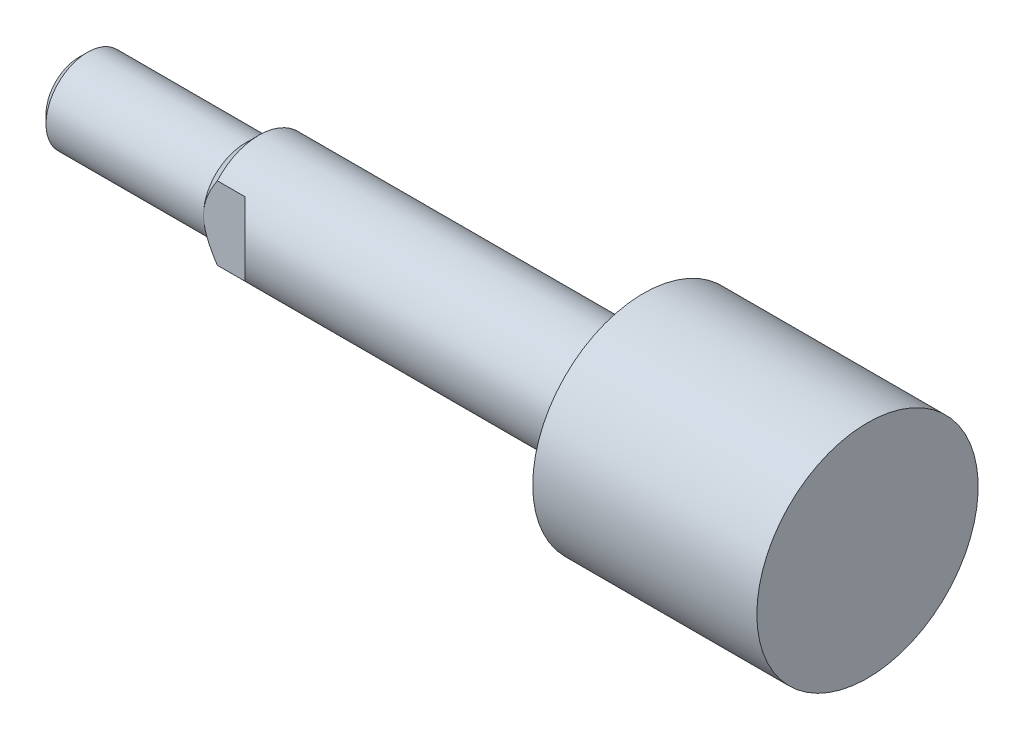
ISO-10303-21;
HEADER;
FILE_DESCRIPTION(('STEP AP214'),'2;1');
FILE_NAME('part.step','',(''),(''),'','','');
FILE_SCHEMA(('AUTOMOTIVE_DESIGN { 1 0 10303 214 1 1 1 1 }'));
ENDSEC;
DATA;
#1=APPLICATION_CONTEXT('core data for automotive mechanical design processes');
#2=APPLICATION_PROTOCOL_DEFINITION('international standard','automotive_design',2000,#1);
#3=PRODUCT_CONTEXT('',#1,'mechanical');
#4=PRODUCT('Part','Part','',(#3));
#5=PRODUCT_RELATED_PRODUCT_CATEGORY('part','',(#4));
#6=PRODUCT_DEFINITION_FORMATION('','',#4);
#7=PRODUCT_DEFINITION_CONTEXT('part definition',#1,'design');
#8=PRODUCT_DEFINITION('design','',#6,#7);
#9=PRODUCT_DEFINITION_SHAPE('','',#8);
#10=(LENGTH_UNIT() NAMED_UNIT(*) SI_UNIT(.MILLI.,.METRE.));
#11=(NAMED_UNIT(*) PLANE_ANGLE_UNIT() SI_UNIT($,.RADIAN.));
#12=(NAMED_UNIT(*) SI_UNIT($,.STERADIAN.) SOLID_ANGLE_UNIT());
#13=UNCERTAINTY_MEASURE_WITH_UNIT(LENGTH_MEASURE(1.E-05),#10,'distance_accuracy_value','');
#14=(GEOMETRIC_REPRESENTATION_CONTEXT(3) GLOBAL_UNCERTAINTY_ASSIGNED_CONTEXT((#13)) GLOBAL_UNIT_ASSIGNED_CONTEXT((#10,
#11,#12)) REPRESENTATION_CONTEXT('',''));
#15=CARTESIAN_POINT('',(0.,0.,0.));
#16=DIRECTION('',(0.,0.,1.));
#17=DIRECTION('',(1.,0.,0.));
#18=AXIS2_PLACEMENT_3D('',#15,#16,#17);
#19=CARTESIAN_POINT('',(-2.5,0.,0.));
#20=DIRECTION('',(1.,0.,0.));
#21=DIRECTION('',(0.,0.,-1.));
#22=AXIS2_PLACEMENT_3D('',#19,#20,#21);
#23=CONICAL_SURFACE('',#22,4.,0.785398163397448);
#24=CARTESIAN_POINT('',(-2.5,0.,0.));
#25=DIRECTION('',(-1.,0.,0.));
#26=DIRECTION('',(0.,0.,1.));
#27=AXIS2_PLACEMENT_3D('',#24,#25,#26);
#28=CIRCLE('',#27,4.);
#29=CARTESIAN_POINT('',(-2.5,2.64575131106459,3.));
#30=VERTEX_POINT('',#29);
#31=CARTESIAN_POINT('',(-2.5,2.64575131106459,-3.));
#32=VERTEX_POINT('',#31);
#33=EDGE_CURVE('E86',#30,#32,#28,.T.);
#34=ORIENTED_EDGE('',*,*,#33,.T.);
#35=CARTESIAN_POINT('',(0.0545194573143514,-5.82766894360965,-3.));
#36=CARTESIAN_POINT('',(-0.0655117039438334,-5.69264565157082,-3.));
#37=CARTESIAN_POINT('',(-0.185077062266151,-5.55720424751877,-3.));
#38=CARTESIAN_POINT('',(-0.423026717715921,-5.28526281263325,-3.));
#39=CARTESIAN_POINT('',(-0.541410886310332,-5.14876266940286,-3.));
#40=CARTESIAN_POINT('',(-0.777239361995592,-4.87390823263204,-3.));
#41=CARTESIAN_POINT('',(-0.894677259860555,-4.73554842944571,-3.));
#42=CARTESIAN_POINT('',(-1.12769999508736,-4.45728579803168,-3.));
#43=CARTESIAN_POINT('',(-1.24328492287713,-4.31738304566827,-3.));
#44=CARTESIAN_POINT('',(-1.478812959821,-4.0273935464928,-3.));
#45=CARTESIAN_POINT('',(-1.59861383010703,-3.87719092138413,-3.));
#46=CARTESIAN_POINT('',(-1.83471594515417,-3.57406261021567,-3.));
#47=CARTESIAN_POINT('',(-1.95101741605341,-3.42113710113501,-3.));
#48=CARTESIAN_POINT('',(-2.17867048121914,-3.11204258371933,-3.));
#49=CARTESIAN_POINT('',(-2.29003042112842,-2.9558797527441,-3.));
#50=CARTESIAN_POINT('',(-2.50611292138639,-2.63905224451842,-3.));
#51=CARTESIAN_POINT('',(-2.61083789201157,-2.47838923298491,-3.));
#52=CARTESIAN_POINT('',(-2.78024812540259,-2.20105121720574,-3.));
#53=CARTESIAN_POINT('',(-2.84740797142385,-2.08589532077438,-3.));
#54=CARTESIAN_POINT('',(-2.97566018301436,-1.85216902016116,-3.));
#55=CARTESIAN_POINT('',(-3.03675066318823,-1.73359756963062,-3.));
#56=CARTESIAN_POINT('',(-3.15040846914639,-1.49359958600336,-3.));
#57=CARTESIAN_POINT('',(-3.20304246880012,-1.37220500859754,-3.));
#58=CARTESIAN_POINT('',(-3.29788029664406,-1.12539482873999,-3.));
#59=CARTESIAN_POINT('',(-3.34009071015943,-0.999981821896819,-3.));
#60=CARTESIAN_POINT('',(-3.40000142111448,-0.785495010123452,-3.));
#61=CARTESIAN_POINT('',(-3.42123449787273,-0.697409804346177,-3.));
#62=CARTESIAN_POINT('',(-3.45654228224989,-0.519807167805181,-3.));
#63=CARTESIAN_POINT('',(-3.47061822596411,-0.430289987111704,-3.));
#64=CARTESIAN_POINT('',(-3.49087054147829,-0.250605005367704,-3.));
#65=CARTESIAN_POINT('',(-3.49706868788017,-0.160439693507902,-3.));
#66=CARTESIAN_POINT('',(-3.50128995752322,0.0200867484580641,-3.));
#67=CARTESIAN_POINT('',(-3.49931298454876,0.110447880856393,-3.));
#68=CARTESIAN_POINT('',(-3.48730850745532,0.290452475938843,-3.));
#69=CARTESIAN_POINT('',(-3.47729628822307,0.38009697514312,-3.));
#70=CARTESIAN_POINT('',(-3.44977513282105,0.558232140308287,-3.));
#71=CARTESIAN_POINT('',(-3.43226439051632,0.646722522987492,-3.));
#72=CARTESIAN_POINT('',(-3.39048841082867,0.822421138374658,-3.));
#73=CARTESIAN_POINT('',(-3.36619833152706,0.909623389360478,-3.));
#74=CARTESIAN_POINT('',(-3.31183291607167,1.0821820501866,-3.));
#75=CARTESIAN_POINT('',(-3.28175761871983,1.16753847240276,-3.));
#76=CARTESIAN_POINT('',(-3.20665207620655,1.36255972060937,-3.));
#77=CARTESIAN_POINT('',(-3.15987705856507,1.47154946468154,-3.));
#78=CARTESIAN_POINT('',(-3.05976597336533,1.68649433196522,-3.));
#79=CARTESIAN_POINT('',(-3.00642658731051,1.79244788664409,-3.));
#80=CARTESIAN_POINT('',(-2.8945308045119,2.00181172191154,-3.));
#81=CARTESIAN_POINT('',(-2.83596429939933,2.10521655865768,-3.));
#82=CARTESIAN_POINT('',(-2.71482595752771,2.30961365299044,-3.));
#83=CARTESIAN_POINT('',(-2.65225477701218,2.41060630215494,-3.));
#84=CARTESIAN_POINT('',(-2.52301843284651,2.61197774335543,-3.));
#85=CARTESIAN_POINT('',(-2.45630744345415,2.71232698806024,-3.));
#86=CARTESIAN_POINT('',(-2.32027971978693,2.91124115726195,-3.));
#87=CARTESIAN_POINT('',(-2.25096290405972,3.00980602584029,-3.));
#88=CARTESIAN_POINT('',(-2.11031358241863,3.20530008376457,-3.));
#89=CARTESIAN_POINT('',(-2.03898364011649,3.30223112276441,-3.));
#90=CARTESIAN_POINT('',(-1.89461337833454,3.49480227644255,-3.));
#91=CARTESIAN_POINT('',(-1.82157312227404,3.59044243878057,-3.));
#92=CARTESIAN_POINT('',(-1.6598676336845,3.79894899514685,-3.));
#93=CARTESIAN_POINT('',(-1.57090369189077,3.91158345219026,-3.));
#94=CARTESIAN_POINT('',(-1.39134957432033,4.1355501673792,-3.));
#95=CARTESIAN_POINT('',(-1.30075935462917,4.24688239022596,-3.));
#96=CARTESIAN_POINT('',(-1.02698944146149,4.57927058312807,-3.));
#97=CARTESIAN_POINT('',(-0.841828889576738,4.79869462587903,-3.));
#98=CARTESIAN_POINT('',(-0.467797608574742,5.23449193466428,-3.));
#99=CARTESIAN_POINT('',(-0.278925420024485,5.45086394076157,-3.));
#100=CARTESIAN_POINT('',(0.10146128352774,5.88127733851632,-3.));
#101=CARTESIAN_POINT('',(0.292975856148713,6.09531867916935,-3.));
#102=CARTESIAN_POINT('',(0.678347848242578,6.52204578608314,-3.));
#103=CARTESIAN_POINT('',(0.872209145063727,6.73472804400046,-3.));
#104=CARTESIAN_POINT('',(1.2614457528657,7.15870603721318,-3.));
#105=CARTESIAN_POINT('',(1.45682108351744,7.370001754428,-3.));
#106=CARTESIAN_POINT('',(2.04459894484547,8.00215026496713,-3.));
#107=CARTESIAN_POINT('',(2.43875284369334,8.42137383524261,-3.));
#108=CARTESIAN_POINT('',(3.18336011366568,9.20767583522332,-3.));
#109=CARTESIAN_POINT('',(3.53348148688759,9.5750696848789,-3.));
#110=CARTESIAN_POINT('',(4.23542736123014,10.3082794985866,-3.));
#111=CARTESIAN_POINT('',(4.58725198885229,10.6740953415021,-3.));
#112=CARTESIAN_POINT('',(5.29094267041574,11.4033091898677,-3.));
#113=CARTESIAN_POINT('',(5.64280459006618,11.7667111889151,-3.));
#114=CARTESIAN_POINT('',(6.34744425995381,12.4925661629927,-3.));
#115=CARTESIAN_POINT('',(6.700221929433,12.8550192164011,-3.));
#116=CARTESIAN_POINT('',(7.05333509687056,13.2171438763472,-3.));
#117=B_SPLINE_CURVE_WITH_KNOTS('',3,(#35,#36,#37,#38,#39,#40,#41,#42,#43,#44,#45,#46,#47,#48,
#49,#50,#51,#52,#53,#54,#55,#56,#57,#58,#59,#60,#61,#62,#63,#64,#65,#66,#67,#68,#69,#70,#71,#72,
#73,#74,#75,#76,#77,#78,#79,#80,#81,#82,#83,#84,#85,#86,#87,#88,#89,#90,#91,#92,#93,#94,#95,#96,
#97,#98,#99,#100,#101,#102,#103,#104,#105,#106,#107,#108,#109,#110,#111,#112,#113,#114,#115,
#116),.UNSPECIFIED.,.F.,.F.,(4,2,2,2,2,2,2,2,2,2,2,2,2,2,2,2,2,2,2,2,2,2,2,2,2,2,2,2,2,2,2,2,2,
2,2,2,2,2,2,2,4),(0.,0.541989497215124,1.084037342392,1.62846524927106,2.17286650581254,
2.74921195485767,3.32552007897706,3.90081464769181,4.47589901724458,4.87569159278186,
5.27560797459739,5.67219758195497,6.06853599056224,6.34010826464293,6.6116336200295,
6.88240682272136,7.15318321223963,7.42344574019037,7.69377340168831,7.96510494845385,
8.23643467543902,8.5919518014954,8.9476493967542,9.30405040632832,9.66039316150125,
10.0218435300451,10.383305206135,10.7443256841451,11.1053327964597,11.5359059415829,
11.966490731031,12.8277497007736,13.6893543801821,14.5509778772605,15.4143015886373,
16.2776365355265,18.0038627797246,19.5263781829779,21.0490084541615,22.566508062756,
24.083878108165),.UNSPECIFIED.);
#118=CARTESIAN_POINT('',(-3.5,0.,-3.));
#119=VERTEX_POINT('',#118);
#120=EDGE_CURVE('E89',#32,#119,#117,.F.);
#121=ORIENTED_EDGE('',*,*,#120,.T.);
#122=CARTESIAN_POINT('',(-3.5,0.,0.));
#123=DIRECTION('',(-1.,0.,0.));
#124=DIRECTION('',(0.,0.,1.));
#125=AXIS2_PLACEMENT_3D('',#122,#123,#124);
#126=CIRCLE('',#125,3.);
#127=CARTESIAN_POINT('',(-3.5,0.,3.));
#128=VERTEX_POINT('',#127);
#129=EDGE_CURVE('E85',#128,#119,#126,.T.);
#130=ORIENTED_EDGE('',*,*,#129,.F.);
#131=CARTESIAN_POINT('',(0.0545194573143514,-5.82766894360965,3.));
#132=CARTESIAN_POINT('',(-0.0655117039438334,-5.69264565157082,3.));
#133=CARTESIAN_POINT('',(-0.185077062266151,-5.55720424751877,3.));
#134=CARTESIAN_POINT('',(-0.423026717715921,-5.28526281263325,3.));
#135=CARTESIAN_POINT('',(-0.541410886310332,-5.14876266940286,3.));
#136=CARTESIAN_POINT('',(-0.777239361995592,-4.87390823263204,3.));
#137=CARTESIAN_POINT('',(-0.894677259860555,-4.73554842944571,3.));
#138=CARTESIAN_POINT('',(-1.12769999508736,-4.45728579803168,3.));
#139=CARTESIAN_POINT('',(-1.24328492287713,-4.31738304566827,3.));
#140=CARTESIAN_POINT('',(-1.478812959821,-4.0273935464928,3.));
#141=CARTESIAN_POINT('',(-1.59861383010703,-3.87719092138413,3.));
#142=CARTESIAN_POINT('',(-1.83471594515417,-3.57406261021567,3.));
#143=CARTESIAN_POINT('',(-1.95101741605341,-3.42113710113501,3.));
#144=CARTESIAN_POINT('',(-2.17867048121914,-3.11204258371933,3.));
#145=CARTESIAN_POINT('',(-2.29003042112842,-2.9558797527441,3.));
#146=CARTESIAN_POINT('',(-2.50611292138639,-2.63905224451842,3.));
#147=CARTESIAN_POINT('',(-2.61083789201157,-2.47838923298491,3.));
#148=CARTESIAN_POINT('',(-2.78024812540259,-2.20105121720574,3.));
#149=CARTESIAN_POINT('',(-2.84740797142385,-2.08589532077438,3.));
#150=CARTESIAN_POINT('',(-2.97566018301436,-1.85216902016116,3.));
#151=CARTESIAN_POINT('',(-3.03675066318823,-1.73359756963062,3.));
#152=CARTESIAN_POINT('',(-3.15040846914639,-1.49359958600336,3.));
#153=CARTESIAN_POINT('',(-3.20304246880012,-1.37220500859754,3.));
#154=CARTESIAN_POINT('',(-3.29788029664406,-1.12539482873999,3.));
#155=CARTESIAN_POINT('',(-3.34009071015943,-0.999981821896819,3.));
#156=CARTESIAN_POINT('',(-3.40000142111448,-0.785495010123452,3.));
#157=CARTESIAN_POINT('',(-3.42123449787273,-0.697409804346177,3.));
#158=CARTESIAN_POINT('',(-3.45654228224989,-0.519807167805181,3.));
#159=CARTESIAN_POINT('',(-3.47061822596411,-0.430289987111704,3.));
#160=CARTESIAN_POINT('',(-3.49087054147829,-0.250605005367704,3.));
#161=CARTESIAN_POINT('',(-3.49706868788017,-0.160439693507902,3.));
#162=CARTESIAN_POINT('',(-3.50128995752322,0.0200867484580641,3.));
#163=CARTESIAN_POINT('',(-3.49931298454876,0.110447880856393,3.));
#164=CARTESIAN_POINT('',(-3.48730850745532,0.290452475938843,3.));
#165=CARTESIAN_POINT('',(-3.47729628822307,0.38009697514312,3.));
#166=CARTESIAN_POINT('',(-3.44977513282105,0.558232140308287,3.));
#167=CARTESIAN_POINT('',(-3.43226439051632,0.646722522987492,3.));
#168=CARTESIAN_POINT('',(-3.39048841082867,0.822421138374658,3.));
#169=CARTESIAN_POINT('',(-3.36619833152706,0.909623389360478,3.));
#170=CARTESIAN_POINT('',(-3.31183291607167,1.0821820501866,3.));
#171=CARTESIAN_POINT('',(-3.28175761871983,1.16753847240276,3.));
#172=CARTESIAN_POINT('',(-3.20665207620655,1.36255972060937,3.));
#173=CARTESIAN_POINT('',(-3.15987705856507,1.47154946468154,3.));
#174=CARTESIAN_POINT('',(-3.05976597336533,1.68649433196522,3.));
#175=CARTESIAN_POINT('',(-3.00642658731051,1.79244788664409,3.));
#176=CARTESIAN_POINT('',(-2.8945308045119,2.00181172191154,3.));
#177=CARTESIAN_POINT('',(-2.83596429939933,2.10521655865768,3.));
#178=CARTESIAN_POINT('',(-2.71482595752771,2.30961365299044,3.));
#179=CARTESIAN_POINT('',(-2.65225477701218,2.41060630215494,3.));
#180=CARTESIAN_POINT('',(-2.52301843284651,2.61197774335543,3.));
#181=CARTESIAN_POINT('',(-2.45630744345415,2.71232698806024,3.));
#182=CARTESIAN_POINT('',(-2.32027971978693,2.91124115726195,3.));
#183=CARTESIAN_POINT('',(-2.25096290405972,3.00980602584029,3.));
#184=CARTESIAN_POINT('',(-2.11031358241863,3.20530008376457,3.));
#185=CARTESIAN_POINT('',(-2.03898364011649,3.30223112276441,3.));
#186=CARTESIAN_POINT('',(-1.89461337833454,3.49480227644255,3.));
#187=CARTESIAN_POINT('',(-1.82157312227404,3.59044243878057,3.));
#188=CARTESIAN_POINT('',(-1.6598676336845,3.79894899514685,3.));
#189=CARTESIAN_POINT('',(-1.57090369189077,3.91158345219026,3.));
#190=CARTESIAN_POINT('',(-1.39134957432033,4.1355501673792,3.));
#191=CARTESIAN_POINT('',(-1.30075935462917,4.24688239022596,3.));
#192=CARTESIAN_POINT('',(-1.02698944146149,4.57927058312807,3.));
#193=CARTESIAN_POINT('',(-0.841828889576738,4.79869462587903,3.));
#194=CARTESIAN_POINT('',(-0.467797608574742,5.23449193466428,3.));
#195=CARTESIAN_POINT('',(-0.278925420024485,5.45086394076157,3.));
#196=CARTESIAN_POINT('',(0.10146128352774,5.88127733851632,3.));
#197=CARTESIAN_POINT('',(0.292975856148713,6.09531867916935,3.));
#198=CARTESIAN_POINT('',(0.678347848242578,6.52204578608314,3.));
#199=CARTESIAN_POINT('',(0.872209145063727,6.73472804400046,3.));
#200=CARTESIAN_POINT('',(1.2614457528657,7.15870603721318,3.));
#201=CARTESIAN_POINT('',(1.45682108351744,7.370001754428,3.));
#202=CARTESIAN_POINT('',(2.04459894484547,8.00215026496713,3.));
#203=CARTESIAN_POINT('',(2.43875284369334,8.42137383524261,3.));
#204=CARTESIAN_POINT('',(3.18336011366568,9.20767583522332,3.));
#205=CARTESIAN_POINT('',(3.53348148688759,9.5750696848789,3.));
#206=CARTESIAN_POINT('',(4.23542736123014,10.3082794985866,3.));
#207=CARTESIAN_POINT('',(4.58725198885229,10.6740953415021,3.));
#208=CARTESIAN_POINT('',(5.29094267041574,11.4033091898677,3.));
#209=CARTESIAN_POINT('',(5.64280459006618,11.7667111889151,3.));
#210=CARTESIAN_POINT('',(6.34744425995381,12.4925661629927,3.));
#211=CARTESIAN_POINT('',(6.700221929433,12.8550192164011,3.));
#212=CARTESIAN_POINT('',(7.05333509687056,13.2171438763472,3.));
#213=B_SPLINE_CURVE_WITH_KNOTS('',3,(#131,#132,#133,#134,#135,#136,#137,#138,#139,#140,#141,
#142,#143,#144,#145,#146,#147,#148,#149,#150,#151,#152,#153,#154,#155,#156,#157,#158,#159,#160,
#161,#162,#163,#164,#165,#166,#167,#168,#169,#170,#171,#172,#173,#174,#175,#176,#177,#178,#179,
#180,#181,#182,#183,#184,#185,#186,#187,#188,#189,#190,#191,#192,#193,#194,#195,#196,#197,#198,
#199,#200,#201,#202,#203,#204,#205,#206,#207,#208,#209,#210,#211,#212),.UNSPECIFIED.,.F.,.F.,(4,
2,2,2,2,2,2,2,2,2,2,2,2,2,2,2,2,2,2,2,2,2,2,2,2,2,2,2,2,2,2,2,2,2,2,2,2,2,2,2,4),(0.,
0.541989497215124,1.084037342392,1.62846524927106,2.17286650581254,2.74921195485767,
3.32552007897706,3.90081464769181,4.47589901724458,4.87569159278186,5.27560797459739,
5.67219758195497,6.06853599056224,6.34010826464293,6.6116336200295,6.88240682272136,
7.15318321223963,7.42344574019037,7.69377340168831,7.96510494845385,8.23643467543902,
8.5919518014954,8.9476493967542,9.30405040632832,9.66039316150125,10.0218435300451,
10.383305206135,10.7443256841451,11.1053327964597,11.5359059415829,11.966490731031,
12.8277497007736,13.6893543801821,14.5509778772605,15.4143015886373,16.2776365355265,
18.0038627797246,19.5263781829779,21.0490084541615,22.566508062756,24.083878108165),.UNSPECIFIED.);
#214=EDGE_CURVE('E62',#128,#30,#213,.T.);
#215=ORIENTED_EDGE('',*,*,#214,.T.);
#216=EDGE_LOOP('',(#34,#121,#130,#215));
#217=FACE_BOUND('',#216,.T.);
#218=ADVANCED_FACE('F16',(#217),#23,.T.);
#219=CARTESIAN_POINT('',(41.5,0.,0.));
#220=DIRECTION('',(-1.,0.,0.));
#221=DIRECTION('',(0.,0.,1.));
#222=AXIS2_PLACEMENT_3D('',#219,#220,#221);
#223=CYLINDRICAL_SURFACE('',#222,4.);
#224=CARTESIAN_POINT('',(25.3,0.,0.));
#225=DIRECTION('',(-1.,0.,0.));
#226=DIRECTION('',(0.,0.,1.));
#227=AXIS2_PLACEMENT_3D('',#224,#225,#226);
#228=CIRCLE('',#227,4.);
#229=CARTESIAN_POINT('',(25.3,0.,4.));
#230=VERTEX_POINT('',#229);
#231=EDGE_CURVE('E71',#230,#230,#228,.T.);
#232=ORIENTED_EDGE('',*,*,#231,.T.);
#233=EDGE_LOOP('',(#232));
#234=FACE_BOUND('',#233,.T.);
#235=CARTESIAN_POINT('',(-3.5,0.,0.));
#236=DIRECTION('',(0.707106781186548,0.,0.707106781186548));
#237=DIRECTION('',(-0.707106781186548,0.,0.707106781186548));
#238=AXIS2_PLACEMENT_3D('',#235,#236,#237);
#239=ELLIPSE('',#238,5.65685424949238,4.);
#240=CARTESIAN_POINT('',(-0.5,-2.64575131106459,-3.));
#241=VERTEX_POINT('',#240);
#242=CARTESIAN_POINT('',(-0.5,2.64575131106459,-3.));
#243=VERTEX_POINT('',#242);
#244=EDGE_CURVE('E11',#241,#243,#239,.T.);
#245=ORIENTED_EDGE('',*,*,#244,.T.);
#246=DIRECTION('',(-1.,0.,0.));
#247=VECTOR('',#246,1.);
#248=CARTESIAN_POINT('',(41.5,2.64575131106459,-3.));
#249=LINE('',#248,#247);
#250=EDGE_CURVE('E183',#243,#32,#249,.T.);
#251=ORIENTED_EDGE('',*,*,#250,.T.);
#252=ORIENTED_EDGE('',*,*,#33,.F.);
#253=DIRECTION('',(-1.,0.,0.));
#254=VECTOR('',#253,1.);
#255=CARTESIAN_POINT('',(41.5,2.64575131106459,3.));
#256=LINE('',#255,#254);
#257=CARTESIAN_POINT('',(-0.5,2.64575131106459,3.));
#258=VERTEX_POINT('',#257);
#259=EDGE_CURVE('E39',#30,#258,#256,.F.);
#260=ORIENTED_EDGE('',*,*,#259,.T.);
#261=CARTESIAN_POINT('',(-3.5,0.,0.));
#262=DIRECTION('',(0.707106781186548,0.,-0.707106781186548));
#263=DIRECTION('',(-0.707106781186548,0.,-0.707106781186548));
#264=AXIS2_PLACEMENT_3D('',#261,#262,#263);
#265=ELLIPSE('',#264,5.65685424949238,4.);
#266=CARTESIAN_POINT('',(-0.5,-2.6457513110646,3.));
#267=VERTEX_POINT('',#266);
#268=EDGE_CURVE('E24',#258,#267,#265,.T.);
#269=ORIENTED_EDGE('',*,*,#268,.T.);
#270=DIRECTION('',(-1.,0.,0.));
#271=VECTOR('',#270,1.);
#272=CARTESIAN_POINT('',(41.5,-2.64575131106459,3.));
#273=LINE('',#272,#271);
#274=CARTESIAN_POINT('',(-2.4999999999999,-2.64575131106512,3.));
#275=VERTEX_POINT('',#274);
#276=EDGE_CURVE('E188',#267,#275,#273,.T.);
#277=ORIENTED_EDGE('',*,*,#276,.T.);
#278=CARTESIAN_POINT('',(-2.5,-2.64575131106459,-3.));
#279=VERTEX_POINT('',#278);
#280=EDGE_CURVE('E81',#279,#275,#28,.T.);
#281=ORIENTED_EDGE('',*,*,#280,.F.);
#282=DIRECTION('',(-1.,0.,0.));
#283=VECTOR('',#282,1.);
#284=CARTESIAN_POINT('',(41.5,-2.64575131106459,-3.));
#285=LINE('',#284,#283);
#286=EDGE_CURVE('E31',#279,#241,#285,.F.);
#287=ORIENTED_EDGE('',*,*,#286,.T.);
#288=EDGE_LOOP('',(#245,#251,#252,#260,#269,#277,#281,#287));
#289=FACE_BOUND('',#288,.T.);
#290=ADVANCED_FACE('F18',(#234,#289),#223,.T.);
#291=CARTESIAN_POINT('',(25.3,4.,0.));
#292=DIRECTION('',(1.,0.,0.));
#293=DIRECTION('',(0.,0.,-1.));
#294=AXIS2_PLACEMENT_3D('',#291,#292,#293);
#295=PLANE('',#294);
#296=ORIENTED_EDGE('',*,*,#231,.F.);
#297=EDGE_LOOP('',(#296));
#298=FACE_BOUND('',#297,.T.);
#299=CARTESIAN_POINT('',(25.3,0.,0.));
#300=DIRECTION('',(-1.,0.,0.));
#301=DIRECTION('',(0.,0.,1.));
#302=AXIS2_PLACEMENT_3D('',#299,#300,#301);
#303=CIRCLE('',#302,8.);
#304=CARTESIAN_POINT('',(25.3,0.,8.));
#305=VERTEX_POINT('',#304);
#306=EDGE_CURVE('E102',#305,#305,#303,.T.);
#307=ORIENTED_EDGE('',*,*,#306,.T.);
#308=EDGE_LOOP('',(#307));
#309=FACE_BOUND('',#308,.T.);
#310=ADVANCED_FACE('F142',(#298,#309),#295,.F.);
#311=CARTESIAN_POINT('',(41.5,0.,0.));
#312=DIRECTION('',(-1.,0.,0.));
#313=DIRECTION('',(0.,0.,1.));
#314=AXIS2_PLACEMENT_3D('',#311,#312,#313);
#315=CYLINDRICAL_SURFACE('',#314,8.);
#316=ORIENTED_EDGE('',*,*,#306,.F.);
#317=EDGE_LOOP('',(#316));
#318=FACE_BOUND('',#317,.T.);
#319=CARTESIAN_POINT('',(41.5,0.,0.));
#320=DIRECTION('',(-1.,0.,0.));
#321=DIRECTION('',(0.,0.,1.));
#322=AXIS2_PLACEMENT_3D('',#319,#320,#321);
#323=CIRCLE('',#322,8.);
#324=CARTESIAN_POINT('',(41.5,0.,8.));
#325=VERTEX_POINT('',#324);
#326=EDGE_CURVE('E99',#325,#325,#323,.T.);
#327=ORIENTED_EDGE('',*,*,#326,.T.);
#328=EDGE_LOOP('',(#327));
#329=FACE_BOUND('',#328,.T.);
#330=ADVANCED_FACE('F167',(#318,#329),#315,.T.);
#331=CARTESIAN_POINT('',(41.5,8.,0.));
#332=DIRECTION('',(-1.,0.,0.));
#333=DIRECTION('',(0.,0.,1.));
#334=AXIS2_PLACEMENT_3D('',#331,#332,#333);
#335=PLANE('',#334);
#336=ORIENTED_EDGE('',*,*,#326,.F.);
#337=EDGE_LOOP('',(#336));
#338=FACE_BOUND('',#337,.T.);
#339=ADVANCED_FACE('F163',(#338),#335,.F.);
#340=CARTESIAN_POINT('',(-15.5,0.,0.));
#341=DIRECTION('',(1.,0.,0.));
#342=DIRECTION('',(0.,0.,-1.));
#343=AXIS2_PLACEMENT_3D('',#340,#341,#342);
#344=PLANE('',#343);
#345=CARTESIAN_POINT('',(-15.5,0.,0.));
#346=DIRECTION('',(-1.,0.,0.));
#347=DIRECTION('',(0.,0.,1.));
#348=AXIS2_PLACEMENT_3D('',#345,#346,#347);
#349=CIRCLE('',#348,2.3865);
#350=CARTESIAN_POINT('',(-15.5,0.,2.3865));
#351=VERTEX_POINT('',#350);
#352=EDGE_CURVE('E92',#351,#351,#349,.T.);
#353=ORIENTED_EDGE('',*,*,#352,.T.);
#354=EDGE_LOOP('',(#353));
#355=FACE_BOUND('',#354,.T.);
#356=ADVANCED_FACE('F156',(#355),#344,.F.);
#357=CARTESIAN_POINT('',(-14.8865,0.,0.));
#358=DIRECTION('',(1.,0.,0.));
#359=DIRECTION('',(0.,0.,-1.));
#360=AXIS2_PLACEMENT_3D('',#357,#358,#359);
#361=CONICAL_SURFACE('',#360,3.,0.785398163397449);
#362=ORIENTED_EDGE('',*,*,#352,.F.);
#363=EDGE_LOOP('',(#362));
#364=FACE_BOUND('',#363,.T.);
#365=CARTESIAN_POINT('',(-14.8865,0.,0.));
#366=DIRECTION('',(-1.,0.,0.));
#367=DIRECTION('',(0.,0.,1.));
#368=AXIS2_PLACEMENT_3D('',#365,#366,#367);
#369=CIRCLE('',#368,3.);
#370=CARTESIAN_POINT('',(-14.8865,0.,3.));
#371=VERTEX_POINT('',#370);
#372=EDGE_CURVE('E90',#371,#371,#369,.T.);
#373=ORIENTED_EDGE('',*,*,#372,.T.);
#374=EDGE_LOOP('',(#373));
#375=FACE_BOUND('',#374,.T.);
#376=ADVANCED_FACE('F150',(#364,#375),#361,.T.);
#377=CARTESIAN_POINT('',(0.,0.,0.));
#378=DIRECTION('',(-1.,0.,0.));
#379=DIRECTION('',(0.,0.,1.));
#380=AXIS2_PLACEMENT_3D('',#377,#378,#379);
#381=CYLINDRICAL_SURFACE('',#380,3.);
#382=ORIENTED_EDGE('',*,*,#372,.F.);
#383=EDGE_LOOP('',(#382));
#384=FACE_BOUND('',#383,.T.);
#385=ORIENTED_EDGE('',*,*,#129,.T.);
#386=EDGE_CURVE('E78',#119,#128,#126,.T.);
#387=ORIENTED_EDGE('',*,*,#386,.T.);
#388=EDGE_LOOP('',(#385,#387));
#389=FACE_BOUND('',#388,.T.);
#390=ADVANCED_FACE('F84',(#384,#389),#381,.T.);
#391=ORIENTED_EDGE('',*,*,#386,.F.);
#392=EDGE_CURVE('E82',#119,#279,#117,.F.);
#393=ORIENTED_EDGE('',*,*,#392,.T.);
#394=ORIENTED_EDGE('',*,*,#280,.T.);
#395=EDGE_CURVE('E65',#275,#128,#213,.T.);
#396=ORIENTED_EDGE('',*,*,#395,.T.);
#397=EDGE_LOOP('',(#391,#393,#394,#396));
#398=FACE_BOUND('',#397,.T.);
#399=ADVANCED_FACE('F77',(#398),#23,.T.);
#400=CARTESIAN_POINT('',(-0.5,-6.,3.));
#401=DIRECTION('',(0.,0.,-1.));
#402=DIRECTION('',(-1.,0.,0.));
#403=AXIS2_PLACEMENT_3D('',#400,#401,#402);
#404=PLANE('',#403);
#405=DIRECTION('',(0.,1.,0.));
#406=VECTOR('',#405,1.);
#407=CARTESIAN_POINT('',(-0.5,-6.,3.));
#408=LINE('',#407,#406);
#409=EDGE_CURVE('E186',#267,#258,#408,.T.);
#410=ORIENTED_EDGE('',*,*,#409,.T.);
#411=ORIENTED_EDGE('',*,*,#259,.F.);
#412=ORIENTED_EDGE('',*,*,#214,.F.);
#413=ORIENTED_EDGE('',*,*,#395,.F.);
#414=ORIENTED_EDGE('',*,*,#276,.F.);
#415=EDGE_LOOP('',(#410,#411,#412,#413,#414));
#416=FACE_BOUND('',#415,.T.);
#417=ADVANCED_FACE('F64',(#416),#404,.F.);
#418=CARTESIAN_POINT('',(19.5,-6.,23.));
#419=DIRECTION('',(0.707106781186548,0.,-0.707106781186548));
#420=DIRECTION('',(-0.707106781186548,0.,-0.707106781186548));
#421=AXIS2_PLACEMENT_3D('',#418,#419,#420);
#422=PLANE('',#421);
#423=ORIENTED_EDGE('',*,*,#409,.F.);
#424=ORIENTED_EDGE('',*,*,#268,.F.);
#425=EDGE_LOOP('',(#423,#424));
#426=FACE_BOUND('',#425,.T.);
#427=ADVANCED_FACE('F123',(#426),#422,.F.);
#428=CARTESIAN_POINT('',(-0.5,-6.,-3.));
#429=DIRECTION('',(0.707106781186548,0.,0.707106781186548));
#430=DIRECTION('',(0.707106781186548,0.,-0.707106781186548));
#431=AXIS2_PLACEMENT_3D('',#428,#429,#430);
#432=PLANE('',#431);
#433=DIRECTION('',(0.,1.,0.));
#434=VECTOR('',#433,1.);
#435=CARTESIAN_POINT('',(-0.5,-6.,-3.));
#436=LINE('',#435,#434);
#437=EDGE_CURVE('E185',#241,#243,#436,.T.);
#438=ORIENTED_EDGE('',*,*,#437,.T.);
#439=ORIENTED_EDGE('',*,*,#244,.F.);
#440=EDGE_LOOP('',(#438,#439));
#441=FACE_BOUND('',#440,.T.);
#442=ADVANCED_FACE('F128',(#441),#432,.F.);
#443=CARTESIAN_POINT('',(-3.5,-6.,-3.));
#444=DIRECTION('',(0.,0.,1.));
#445=DIRECTION('',(1.,0.,0.));
#446=AXIS2_PLACEMENT_3D('',#443,#444,#445);
#447=PLANE('',#446);
#448=ORIENTED_EDGE('',*,*,#437,.F.);
#449=ORIENTED_EDGE('',*,*,#286,.F.);
#450=ORIENTED_EDGE('',*,*,#392,.F.);
#451=ORIENTED_EDGE('',*,*,#120,.F.);
#452=ORIENTED_EDGE('',*,*,#250,.F.);
#453=EDGE_LOOP('',(#448,#449,#450,#451,#452));
#454=FACE_BOUND('',#453,.T.);
#455=ADVANCED_FACE('F124',(#454),#447,.F.);
#456=CLOSED_SHELL('',(#218,#290,#310,#330,#339,#356,#376,#390,#399,#417,#427,#442,#455));
#457=MANIFOLD_SOLID_BREP('B1',#456);
#458=ADVANCED_BREP_SHAPE_REPRESENTATION('',(#18,#457),#14);
#459=SHAPE_DEFINITION_REPRESENTATION(#9,#458);
ENDSEC;
END-ISO-10303-21;
